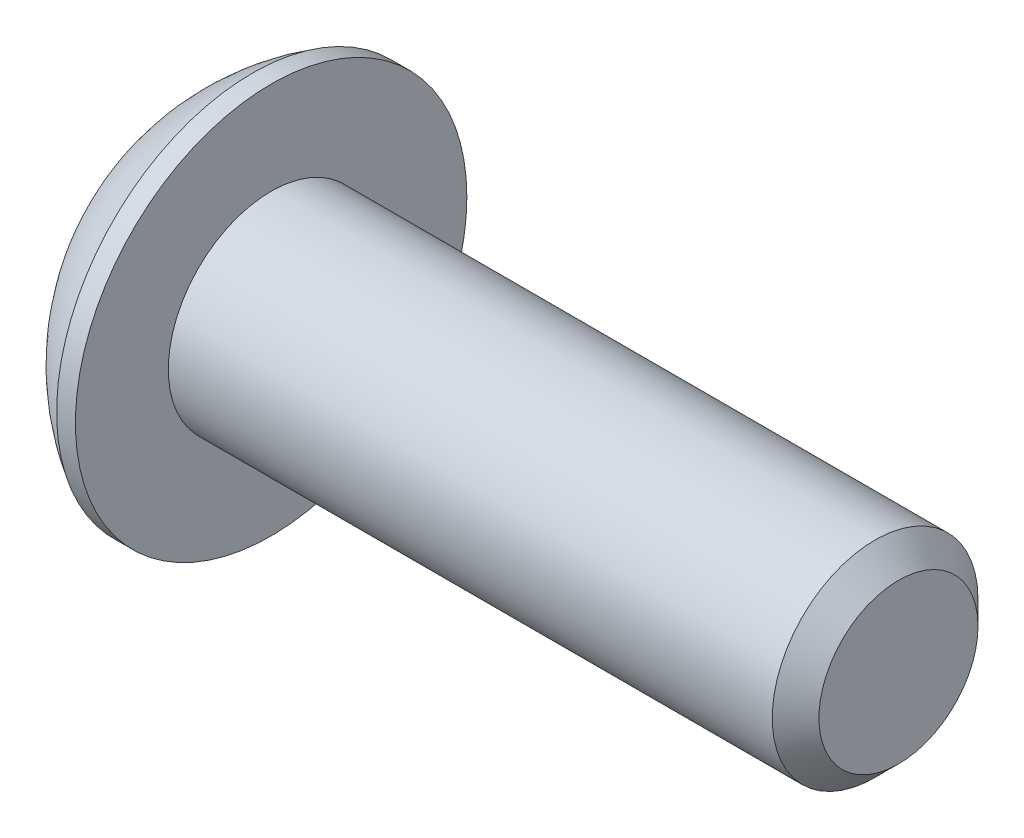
from build123d import *

# Parameters (mm, degrees)
CUT_EXTRUDE1_DEPTH = 1.3208
TAPPED_HOLE1_D     = 2.388
TAPPED_HOLE1_DEPTH = 1.32
TAPPED_HOLE1_TIP   = 0.689356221
CHAMFER1_SIZE      = 0.4724


with BuildPart() as part:
    # Sketch1 → Revolve2 (revolve)
    with BuildSketch(Plane.XY, mode=Mode.PRIVATE) as revolve2_sk:
        with BuildLine():
            Line((7.4549, 0), (-7.4549, 0))
            Line((-7.4549, 0), (-7.4549, 1.9812))
            ThreePointArc((-7.4549, 1.9812), (-6.689453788, 3.109295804), (-5.6261, 3.9624))
            Line((-5.6261, 3.9624), (-5.2451, 3.9624))
            Line((-5.2451, 3.9624), (-5.2451, 2.0828))
            Line((-5.2451, 2.0828), (7.4549, 2.0828))
            Line((7.4549, 2.0828), (7.4549, 0))
        make_face()
    revolve(revolve2_sk.sketch.rotate(Axis((7.4549, 0, 0), (-1, 0, 0)), 90), axis=Axis((7.4549, 0, 0), (-1, 0, 0)))

    # Sketch9 → Cut-Extrude1 (cut)
    with BuildSketch(Plane.ZY.offset(7.4549)):
        Polygon((0, 1.378481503), (1.1938, 0.689240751), (1.1938, -0.689240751), (0, -1.378481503), (-1.1938, -0.689240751), (-1.1938, 0.689240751), align=None)
    extrude(amount=-CUT_EXTRUDE1_DEPTH, mode=Mode.SUBTRACT)

    # Tapped Hole1
    with Locations(Plane(origin=(-7.4549, 0, 0), x_dir=(0, 0, -1), z_dir=(-1, 0, 0))):
        with Locations((0, 0)):
            Hole(TAPPED_HOLE1_D / 2, depth=TAPPED_HOLE1_DEPTH)
            with Locations((0, 0, -(TAPPED_HOLE1_DEPTH + TAPPED_HOLE1_TIP / 2))):  # 120° drill point
                Cone(0, TAPPED_HOLE1_D / 2, TAPPED_HOLE1_TIP, mode=Mode.SUBTRACT)

    # Chamfer1
    chamfer1_edges = [part.edges().sort_by_distance(p)[0] for p in [
        (7.4549, 0, 2.0828),
    ]]
    chamfer(chamfer1_edges, length=CHAMFER1_SIZE)


solid = part.part
